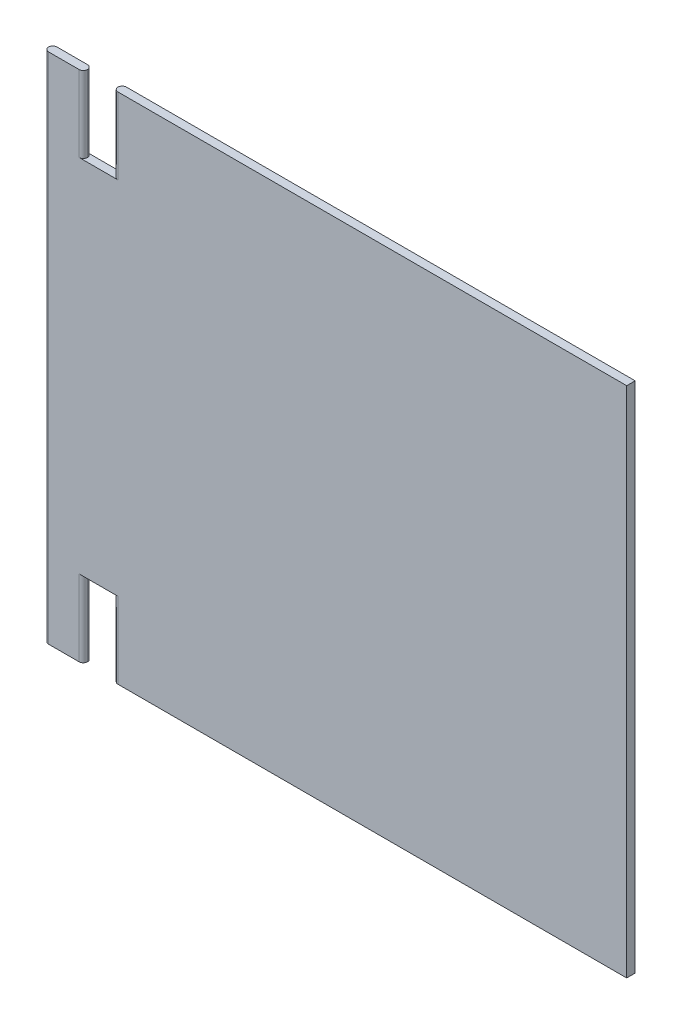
ISO-10303-21;
HEADER;
FILE_DESCRIPTION(('STEP AP214'),'2;1');
FILE_NAME('part.step','',(''),(''),'','','');
FILE_SCHEMA(('AUTOMOTIVE_DESIGN { 1 0 10303 214 1 1 1 1 }'));
ENDSEC;
DATA;
#1=APPLICATION_CONTEXT('core data for automotive mechanical design processes');
#2=APPLICATION_PROTOCOL_DEFINITION('international standard','automotive_design',2000,#1);
#3=PRODUCT_CONTEXT('',#1,'mechanical');
#4=PRODUCT('Part','Part','',(#3));
#5=PRODUCT_RELATED_PRODUCT_CATEGORY('part','',(#4));
#6=PRODUCT_DEFINITION_FORMATION('','',#4);
#7=PRODUCT_DEFINITION_CONTEXT('part definition',#1,'design');
#8=PRODUCT_DEFINITION('design','',#6,#7);
#9=PRODUCT_DEFINITION_SHAPE('','',#8);
#10=(LENGTH_UNIT() NAMED_UNIT(*) SI_UNIT(.MILLI.,.METRE.));
#11=(NAMED_UNIT(*) PLANE_ANGLE_UNIT() SI_UNIT($,.RADIAN.));
#12=(NAMED_UNIT(*) SI_UNIT($,.STERADIAN.) SOLID_ANGLE_UNIT());
#13=UNCERTAINTY_MEASURE_WITH_UNIT(LENGTH_MEASURE(1.E-05),#10,'distance_accuracy_value','');
#14=(GEOMETRIC_REPRESENTATION_CONTEXT(3) GLOBAL_UNCERTAINTY_ASSIGNED_CONTEXT((#13)) GLOBAL_UNIT_ASSIGNED_CONTEXT((#10,
#11,#12)) REPRESENTATION_CONTEXT('',''));
#15=CARTESIAN_POINT('',(0.,0.,0.));
#16=DIRECTION('',(0.,0.,1.));
#17=DIRECTION('',(1.,0.,0.));
#18=AXIS2_PLACEMENT_3D('',#15,#16,#17);
#19=CARTESIAN_POINT('',(38.481,-38.481,1.27));
#20=DIRECTION('',(0.,1.,0.));
#21=DIRECTION('',(-1.,0.,0.));
#22=AXIS2_PLACEMENT_3D('',#19,#20,#21);
#23=PLANE('',#22);
#24=DIRECTION('',(1.,0.,0.));
#25=VECTOR('',#24,1.);
#26=CARTESIAN_POINT('',(38.481,-38.481,1.27));
#27=LINE('',#26,#25);
#28=CARTESIAN_POINT('',(-37.846,-38.481,1.27));
#29=VERTEX_POINT('',#28);
#30=CARTESIAN_POINT('',(38.481,-38.481,1.27));
#31=VERTEX_POINT('',#30);
#32=EDGE_CURVE('E158',#29,#31,#27,.T.);
#33=ORIENTED_EDGE('',*,*,#32,.F.);
#34=CARTESIAN_POINT('',(-37.846,-38.481,0.635));
#35=DIRECTION('',(0.,1.,0.));
#36=DIRECTION('',(-1.,0.,0.));
#37=AXIS2_PLACEMENT_3D('',#34,#35,#36);
#38=CIRCLE('',#37,0.635);
#39=CARTESIAN_POINT('',(-38.481,-38.481,0.635));
#40=VERTEX_POINT('',#39);
#41=EDGE_CURVE('E253',#29,#40,#38,.F.);
#42=ORIENTED_EDGE('',*,*,#41,.T.);
#43=CARTESIAN_POINT('',(-37.846,-38.481,0.635));
#44=DIRECTION('',(0.,1.,0.));
#45=DIRECTION('',(-1.,0.,0.));
#46=AXIS2_PLACEMENT_3D('',#43,#44,#45);
#47=CIRCLE('',#46,0.635);
#48=CARTESIAN_POINT('',(-37.846,-38.481,0.));
#49=VERTEX_POINT('',#48);
#50=EDGE_CURVE('E251',#40,#49,#47,.F.);
#51=ORIENTED_EDGE('',*,*,#50,.T.);
#52=DIRECTION('',(1.,0.,0.));
#53=VECTOR('',#52,1.);
#54=CARTESIAN_POINT('',(38.481,-38.481,0.));
#55=LINE('',#54,#53);
#56=CARTESIAN_POINT('',(38.481,-38.481,0.));
#57=VERTEX_POINT('',#56);
#58=EDGE_CURVE('E173',#49,#57,#55,.T.);
#59=ORIENTED_EDGE('',*,*,#58,.T.);
#60=DIRECTION('',(0.,0.,-1.));
#61=VECTOR('',#60,1.);
#62=CARTESIAN_POINT('',(38.481,-38.481,1.27));
#63=LINE('',#62,#61);
#64=EDGE_CURVE('E171',#31,#57,#63,.T.);
#65=ORIENTED_EDGE('',*,*,#64,.F.);
#66=EDGE_LOOP('',(#33,#42,#51,#59,#65));
#67=FACE_BOUND('',#66,.T.);
#68=ADVANCED_FACE('F37',(#67),#23,.F.);
#69=CARTESIAN_POINT('',(38.481,-38.481,1.27));
#70=DIRECTION('',(-1.,0.,0.));
#71=DIRECTION('',(0.,0.,1.));
#72=AXIS2_PLACEMENT_3D('',#69,#70,#71);
#73=PLANE('',#72);
#74=DIRECTION('',(0.,1.,0.));
#75=VECTOR('',#74,1.);
#76=CARTESIAN_POINT('',(38.481,-38.481,0.));
#77=LINE('',#76,#75);
#78=CARTESIAN_POINT('',(38.481,38.481,0.));
#79=VERTEX_POINT('',#78);
#80=EDGE_CURVE('E188',#57,#79,#77,.T.);
#81=ORIENTED_EDGE('',*,*,#80,.T.);
#82=DIRECTION('',(0.,0.,-1.));
#83=VECTOR('',#82,1.);
#84=CARTESIAN_POINT('',(38.481,38.481,1.27));
#85=LINE('',#84,#83);
#86=CARTESIAN_POINT('',(38.481,38.481,1.27));
#87=VERTEX_POINT('',#86);
#88=EDGE_CURVE('E177',#87,#79,#85,.T.);
#89=ORIENTED_EDGE('',*,*,#88,.F.);
#90=DIRECTION('',(0.,1.,0.));
#91=VECTOR('',#90,1.);
#92=CARTESIAN_POINT('',(38.481,-38.481,1.27));
#93=LINE('',#92,#91);
#94=EDGE_CURVE('E163',#31,#87,#93,.T.);
#95=ORIENTED_EDGE('',*,*,#94,.F.);
#96=ORIENTED_EDGE('',*,*,#64,.T.);
#97=EDGE_LOOP('',(#81,#89,#95,#96));
#98=FACE_BOUND('',#97,.T.);
#99=ADVANCED_FACE('F179',(#98),#73,.F.);
#100=CARTESIAN_POINT('',(38.481,38.481,1.27));
#101=DIRECTION('',(0.,-1.,0.));
#102=DIRECTION('',(1.,0.,0.));
#103=AXIS2_PLACEMENT_3D('',#100,#101,#102);
#104=PLANE('',#103);
#105=CARTESIAN_POINT('',(-37.846,38.481,0.635));
#106=DIRECTION('',(0.,-1.,0.));
#107=DIRECTION('',(1.,0.,0.));
#108=AXIS2_PLACEMENT_3D('',#105,#106,#107);
#109=CIRCLE('',#108,0.635);
#110=CARTESIAN_POINT('',(-37.846,38.481,0.));
#111=VERTEX_POINT('',#110);
#112=CARTESIAN_POINT('',(-38.481,38.481,0.635));
#113=VERTEX_POINT('',#112);
#114=EDGE_CURVE('E260',#111,#113,#109,.F.);
#115=ORIENTED_EDGE('',*,*,#114,.T.);
#116=CARTESIAN_POINT('',(-37.846,38.481,0.635));
#117=DIRECTION('',(0.,-1.,0.));
#118=DIRECTION('',(1.,0.,0.));
#119=AXIS2_PLACEMENT_3D('',#116,#117,#118);
#120=CIRCLE('',#119,0.635);
#121=CARTESIAN_POINT('',(-37.846,38.481,1.27));
#122=VERTEX_POINT('',#121);
#123=EDGE_CURVE('E262',#113,#122,#120,.F.);
#124=ORIENTED_EDGE('',*,*,#123,.T.);
#125=DIRECTION('',(-1.,0.,0.));
#126=VECTOR('',#125,1.);
#127=CARTESIAN_POINT('',(38.481,38.481,1.27));
#128=LINE('',#127,#126);
#129=EDGE_CURVE('E182',#87,#122,#128,.T.);
#130=ORIENTED_EDGE('',*,*,#129,.F.);
#131=ORIENTED_EDGE('',*,*,#88,.T.);
#132=DIRECTION('',(-1.,0.,0.));
#133=VECTOR('',#132,1.);
#134=CARTESIAN_POINT('',(38.481,38.481,0.));
#135=LINE('',#134,#133);
#136=EDGE_CURVE('E168',#79,#111,#135,.T.);
#137=ORIENTED_EDGE('',*,*,#136,.T.);
#138=EDGE_LOOP('',(#115,#124,#130,#131,#137));
#139=FACE_BOUND('',#138,.T.);
#140=ADVANCED_FACE('F340',(#139),#104,.F.);
#141=CARTESIAN_POINT('',(0.,0.,1.27));
#142=DIRECTION('',(0.,0.,1.));
#143=DIRECTION('',(1.,0.,0.));
#144=AXIS2_PLACEMENT_3D('',#141,#142,#143);
#145=PLANE('',#144);
#146=DIRECTION('',(1.,0.,0.));
#147=VECTOR('',#146,1.);
#148=CARTESIAN_POINT('',(-43.053,-27.051,1.27000000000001));
#149=LINE('',#148,#147);
#150=CARTESIAN_POINT('',(-43.688,-27.051,1.27000000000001));
#151=VERTEX_POINT('',#150);
#152=CARTESIAN_POINT('',(-37.846,-27.051,1.27000000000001));
#153=VERTEX_POINT('',#152);
#154=EDGE_CURVE('E299',#151,#153,#149,.T.);
#155=ORIENTED_EDGE('',*,*,#154,.T.);
#156=DIRECTION('',(0.,-1.,0.));
#157=VECTOR('',#156,1.);
#158=CARTESIAN_POINT('',(-37.846,-38.481,1.27));
#159=LINE('',#158,#157);
#160=EDGE_CURVE('E166',#153,#29,#159,.T.);
#161=ORIENTED_EDGE('',*,*,#160,.T.);
#162=ORIENTED_EDGE('',*,*,#32,.T.);
#163=ORIENTED_EDGE('',*,*,#94,.T.);
#164=ORIENTED_EDGE('',*,*,#129,.T.);
#165=DIRECTION('',(0.,-1.,0.));
#166=VECTOR('',#165,1.);
#167=CARTESIAN_POINT('',(-37.846,27.051,1.27));
#168=LINE('',#167,#166);
#169=CARTESIAN_POINT('',(-37.846,27.051,1.27));
#170=VERTEX_POINT('',#169);
#171=EDGE_CURVE('E236',#122,#170,#168,.T.);
#172=ORIENTED_EDGE('',*,*,#171,.T.);
#173=DIRECTION('',(1.,0.,0.));
#174=VECTOR('',#173,1.);
#175=CARTESIAN_POINT('',(-43.053,27.051,1.27));
#176=LINE('',#175,#174);
#177=CARTESIAN_POINT('',(-43.688,27.051,1.27));
#178=VERTEX_POINT('',#177);
#179=EDGE_CURVE('E189',#178,#170,#176,.T.);
#180=ORIENTED_EDGE('',*,*,#179,.F.);
#181=DIRECTION('',(0.,1.,0.));
#182=VECTOR('',#181,1.);
#183=CARTESIAN_POINT('',(-43.688,38.481,1.27));
#184=LINE('',#183,#182);
#185=CARTESIAN_POINT('',(-43.688,38.481,1.26999999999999));
#186=VERTEX_POINT('',#185);
#187=EDGE_CURVE('E198',#178,#186,#184,.T.);
#188=ORIENTED_EDGE('',*,*,#187,.T.);
#189=DIRECTION('',(1.,0.,0.));
#190=VECTOR('',#189,1.);
#191=CARTESIAN_POINT('',(-48.895,38.481,1.26999999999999));
#192=LINE('',#191,#190);
#193=CARTESIAN_POINT('',(-48.26,38.481,1.26999999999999));
#194=VERTEX_POINT('',#193);
#195=EDGE_CURVE('E307',#194,#186,#192,.T.);
#196=ORIENTED_EDGE('',*,*,#195,.F.);
#197=DIRECTION('',(0.,1.,0.));
#198=VECTOR('',#197,1.);
#199=CARTESIAN_POINT('',(-48.26,0.,1.27));
#200=LINE('',#199,#198);
#201=CARTESIAN_POINT('',(-48.26,-38.481,1.27));
#202=VERTEX_POINT('',#201);
#203=EDGE_CURVE('E176',#194,#202,#200,.F.);
#204=ORIENTED_EDGE('',*,*,#203,.T.);
#205=DIRECTION('',(1.,0.,0.));
#206=VECTOR('',#205,1.);
#207=CARTESIAN_POINT('',(-48.895,-38.481,1.27));
#208=LINE('',#207,#206);
#209=CARTESIAN_POINT('',(-43.688,-38.481,1.27));
#210=VERTEX_POINT('',#209);
#211=EDGE_CURVE('E304',#202,#210,#208,.T.);
#212=ORIENTED_EDGE('',*,*,#211,.T.);
#213=DIRECTION('',(0.,1.,0.));
#214=VECTOR('',#213,1.);
#215=CARTESIAN_POINT('',(-43.688,-27.051,1.27));
#216=LINE('',#215,#214);
#217=EDGE_CURVE('E195',#210,#151,#216,.T.);
#218=ORIENTED_EDGE('',*,*,#217,.T.);
#219=EDGE_LOOP('',(#155,#161,#162,#163,#164,#172,#180,#188,#196,#204,#212,#218));
#220=FACE_BOUND('',#219,.T.);
#221=ADVANCED_FACE('F160',(#220),#145,.T.);
#222=CARTESIAN_POINT('',(0.,0.,0.));
#223=DIRECTION('',(0.,0.,1.));
#224=DIRECTION('',(1.,0.,0.));
#225=AXIS2_PLACEMENT_3D('',#222,#223,#224);
#226=PLANE('',#225);
#227=ORIENTED_EDGE('',*,*,#58,.F.);
#228=DIRECTION('',(0.,-1.,0.));
#229=VECTOR('',#228,1.);
#230=CARTESIAN_POINT('',(-37.846,0.,0.));
#231=LINE('',#230,#229);
#232=CARTESIAN_POINT('',(-37.846,-27.051,0.));
#233=VERTEX_POINT('',#232);
#234=EDGE_CURVE('E257',#49,#233,#231,.F.);
#235=ORIENTED_EDGE('',*,*,#234,.T.);
#236=DIRECTION('',(1.,0.,0.));
#237=VECTOR('',#236,1.);
#238=CARTESIAN_POINT('',(-43.053,-27.051,0.));
#239=LINE('',#238,#237);
#240=CARTESIAN_POINT('',(-43.688,-27.051,0.));
#241=VERTEX_POINT('',#240);
#242=EDGE_CURVE('E284',#241,#233,#239,.T.);
#243=ORIENTED_EDGE('',*,*,#242,.F.);
#244=DIRECTION('',(0.,-1.,0.));
#245=VECTOR('',#244,1.);
#246=CARTESIAN_POINT('',(-43.688,0.,0.));
#247=LINE('',#246,#245);
#248=CARTESIAN_POINT('',(-43.688,-38.481,0.));
#249=VERTEX_POINT('',#248);
#250=EDGE_CURVE('E212',#241,#249,#247,.T.);
#251=ORIENTED_EDGE('',*,*,#250,.T.);
#252=DIRECTION('',(1.,0.,0.));
#253=VECTOR('',#252,1.);
#254=CARTESIAN_POINT('',(-48.895,-38.481,0.));
#255=LINE('',#254,#253);
#256=CARTESIAN_POINT('',(-48.26,-38.481,0.));
#257=VERTEX_POINT('',#256);
#258=EDGE_CURVE('E301',#257,#249,#255,.T.);
#259=ORIENTED_EDGE('',*,*,#258,.F.);
#260=DIRECTION('',(0.,-1.,0.));
#261=VECTOR('',#260,1.);
#262=CARTESIAN_POINT('',(-48.26,38.481,0.));
#263=LINE('',#262,#261);
#264=CARTESIAN_POINT('',(-48.26,38.481,0.));
#265=VERTEX_POINT('',#264);
#266=EDGE_CURVE('E209',#257,#265,#263,.F.);
#267=ORIENTED_EDGE('',*,*,#266,.T.);
#268=DIRECTION('',(1.,0.,0.));
#269=VECTOR('',#268,1.);
#270=CARTESIAN_POINT('',(-48.895,38.481,0.));
#271=LINE('',#270,#269);
#272=CARTESIAN_POINT('',(-43.688,38.481,0.));
#273=VERTEX_POINT('',#272);
#274=EDGE_CURVE('E240',#265,#273,#271,.T.);
#275=ORIENTED_EDGE('',*,*,#274,.T.);
#276=DIRECTION('',(0.,-1.,0.));
#277=VECTOR('',#276,1.);
#278=CARTESIAN_POINT('',(-43.688,0.,0.));
#279=LINE('',#278,#277);
#280=CARTESIAN_POINT('',(-43.688,27.051,0.));
#281=VERTEX_POINT('',#280);
#282=EDGE_CURVE('E215',#273,#281,#279,.T.);
#283=ORIENTED_EDGE('',*,*,#282,.T.);
#284=DIRECTION('',(1.,0.,0.));
#285=VECTOR('',#284,1.);
#286=CARTESIAN_POINT('',(-43.053,27.051,0.));
#287=LINE('',#286,#285);
#288=CARTESIAN_POINT('',(-37.846,27.051,0.));
#289=VERTEX_POINT('',#288);
#290=EDGE_CURVE('E280',#281,#289,#287,.T.);
#291=ORIENTED_EDGE('',*,*,#290,.T.);
#292=DIRECTION('',(0.,-1.,0.));
#293=VECTOR('',#292,1.);
#294=CARTESIAN_POINT('',(-37.846,0.,0.));
#295=LINE('',#294,#293);
#296=EDGE_CURVE('E255',#289,#111,#295,.F.);
#297=ORIENTED_EDGE('',*,*,#296,.T.);
#298=ORIENTED_EDGE('',*,*,#136,.F.);
#299=ORIENTED_EDGE('',*,*,#80,.F.);
#300=EDGE_LOOP('',(#227,#235,#243,#251,#259,#267,#275,#283,#291,#297,#298,#299));
#301=FACE_BOUND('',#300,.T.);
#302=ADVANCED_FACE('F288',(#301),#226,.F.);
#303=CARTESIAN_POINT('',(-43.053,27.051,1.27));
#304=DIRECTION('',(0.,-1.,0.));
#305=DIRECTION('',(0.,0.,-1.));
#306=AXIS2_PLACEMENT_3D('',#303,#304,#305);
#307=PLANE('',#306);
#308=CARTESIAN_POINT('',(-37.846,27.051,0.635));
#309=DIRECTION('',(0.,-1.,0.));
#310=DIRECTION('',(0.,0.,-1.));
#311=AXIS2_PLACEMENT_3D('',#308,#309,#310);
#312=CIRCLE('',#311,0.635);
#313=CARTESIAN_POINT('',(-38.481,27.051,0.635));
#314=VERTEX_POINT('',#313);
#315=EDGE_CURVE('E46',#170,#314,#312,.T.);
#316=ORIENTED_EDGE('',*,*,#315,.T.);
#317=CARTESIAN_POINT('',(-37.846,27.051,0.635));
#318=DIRECTION('',(0.,-1.,0.));
#319=DIRECTION('',(0.,0.,-1.));
#320=AXIS2_PLACEMENT_3D('',#317,#318,#319);
#321=CIRCLE('',#320,0.635);
#322=EDGE_CURVE('E11',#314,#289,#321,.T.);
#323=ORIENTED_EDGE('',*,*,#322,.T.);
#324=ORIENTED_EDGE('',*,*,#290,.F.);
#325=CARTESIAN_POINT('',(-43.688,27.051,0.635));
#326=DIRECTION('',(0.,-1.,0.));
#327=DIRECTION('',(0.,0.,-1.));
#328=AXIS2_PLACEMENT_3D('',#325,#326,#327);
#329=CIRCLE('',#328,0.635);
#330=CARTESIAN_POINT('',(-43.053,27.051,0.635));
#331=VERTEX_POINT('',#330);
#332=EDGE_CURVE('E229',#281,#331,#329,.T.);
#333=ORIENTED_EDGE('',*,*,#332,.T.);
#334=CARTESIAN_POINT('',(-43.688,27.051,0.635));
#335=DIRECTION('',(0.,-1.,0.));
#336=DIRECTION('',(0.,0.,-1.));
#337=AXIS2_PLACEMENT_3D('',#334,#335,#336);
#338=CIRCLE('',#337,0.635);
#339=EDGE_CURVE('E226',#331,#178,#338,.T.);
#340=ORIENTED_EDGE('',*,*,#339,.T.);
#341=ORIENTED_EDGE('',*,*,#179,.T.);
#342=EDGE_LOOP('',(#316,#323,#324,#333,#340,#341));
#343=FACE_BOUND('',#342,.T.);
#344=ADVANCED_FACE('F279',(#343),#307,.F.);
#345=CARTESIAN_POINT('',(-43.053,-27.051,1.27000000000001));
#346=DIRECTION('',(0.,1.,0.));
#347=DIRECTION('',(0.,0.,1.));
#348=AXIS2_PLACEMENT_3D('',#345,#346,#347);
#349=PLANE('',#348);
#350=ORIENTED_EDGE('',*,*,#242,.T.);
#351=CARTESIAN_POINT('',(-37.846,-27.051,0.635));
#352=DIRECTION('',(0.,1.,0.));
#353=DIRECTION('',(0.,0.,1.));
#354=AXIS2_PLACEMENT_3D('',#351,#352,#353);
#355=CIRCLE('',#354,0.635);
#356=CARTESIAN_POINT('',(-38.481,-27.051,0.635));
#357=VERTEX_POINT('',#356);
#358=EDGE_CURVE('E60',#233,#357,#355,.T.);
#359=ORIENTED_EDGE('',*,*,#358,.T.);
#360=CARTESIAN_POINT('',(-37.846,-27.051,0.635));
#361=DIRECTION('',(0.,1.,0.));
#362=DIRECTION('',(0.,0.,1.));
#363=AXIS2_PLACEMENT_3D('',#360,#361,#362);
#364=CIRCLE('',#363,0.635);
#365=EDGE_CURVE('E264',#357,#153,#364,.T.);
#366=ORIENTED_EDGE('',*,*,#365,.T.);
#367=ORIENTED_EDGE('',*,*,#154,.F.);
#368=CARTESIAN_POINT('',(-43.688,-27.051,0.635));
#369=DIRECTION('',(0.,1.,0.));
#370=DIRECTION('',(0.,0.,1.));
#371=AXIS2_PLACEMENT_3D('',#368,#369,#370);
#372=CIRCLE('',#371,0.635);
#373=CARTESIAN_POINT('',(-43.053,-27.051,0.635));
#374=VERTEX_POINT('',#373);
#375=EDGE_CURVE('E234',#151,#374,#372,.T.);
#376=ORIENTED_EDGE('',*,*,#375,.T.);
#377=CARTESIAN_POINT('',(-43.688,-27.051,0.635));
#378=DIRECTION('',(0.,1.,0.));
#379=DIRECTION('',(0.,0.,1.));
#380=AXIS2_PLACEMENT_3D('',#377,#378,#379);
#381=CIRCLE('',#380,0.635);
#382=EDGE_CURVE('E231',#374,#241,#381,.T.);
#383=ORIENTED_EDGE('',*,*,#382,.T.);
#384=EDGE_LOOP('',(#350,#359,#366,#367,#376,#383));
#385=FACE_BOUND('',#384,.T.);
#386=ADVANCED_FACE('F331',(#385),#349,.F.);
#387=CARTESIAN_POINT('',(-48.895,-38.481,0.));
#388=DIRECTION('',(0.,1.,0.));
#389=DIRECTION('',(0.,0.,1.));
#390=AXIS2_PLACEMENT_3D('',#387,#388,#389);
#391=PLANE('',#390);
#392=ORIENTED_EDGE('',*,*,#258,.T.);
#393=CARTESIAN_POINT('',(-43.688,-38.481,0.635));
#394=DIRECTION('',(0.,1.,0.));
#395=DIRECTION('',(0.,0.,1.));
#396=AXIS2_PLACEMENT_3D('',#393,#394,#395);
#397=CIRCLE('',#396,0.635);
#398=CARTESIAN_POINT('',(-43.053,-38.481,0.635));
#399=VERTEX_POINT('',#398);
#400=EDGE_CURVE('E224',#249,#399,#397,.F.);
#401=ORIENTED_EDGE('',*,*,#400,.T.);
#402=CARTESIAN_POINT('',(-43.688,-38.481,0.635));
#403=DIRECTION('',(0.,1.,0.));
#404=DIRECTION('',(0.,0.,1.));
#405=AXIS2_PLACEMENT_3D('',#402,#403,#404);
#406=CIRCLE('',#405,0.635);
#407=EDGE_CURVE('E222',#399,#210,#406,.F.);
#408=ORIENTED_EDGE('',*,*,#407,.T.);
#409=ORIENTED_EDGE('',*,*,#211,.F.);
#410=CARTESIAN_POINT('',(-48.26,-38.481,0.635));
#411=DIRECTION('',(0.,1.,0.));
#412=DIRECTION('',(0.,0.,1.));
#413=AXIS2_PLACEMENT_3D('',#410,#411,#412);
#414=CIRCLE('',#413,0.635);
#415=CARTESIAN_POINT('',(-48.895,-38.481,0.635));
#416=VERTEX_POINT('',#415);
#417=EDGE_CURVE('E218',#202,#416,#414,.F.);
#418=ORIENTED_EDGE('',*,*,#417,.T.);
#419=CARTESIAN_POINT('',(-48.26,-38.481,0.635));
#420=DIRECTION('',(0.,1.,0.));
#421=DIRECTION('',(0.,0.,1.));
#422=AXIS2_PLACEMENT_3D('',#419,#420,#421);
#423=CIRCLE('',#422,0.635);
#424=EDGE_CURVE('E220',#416,#257,#423,.F.);
#425=ORIENTED_EDGE('',*,*,#424,.T.);
#426=EDGE_LOOP('',(#392,#401,#408,#409,#418,#425));
#427=FACE_BOUND('',#426,.T.);
#428=ADVANCED_FACE('F322',(#427),#391,.F.);
#429=CARTESIAN_POINT('',(-48.895,38.481,0.));
#430=DIRECTION('',(0.,-1.,0.));
#431=DIRECTION('',(0.,0.,-1.));
#432=AXIS2_PLACEMENT_3D('',#429,#430,#431);
#433=PLANE('',#432);
#434=ORIENTED_EDGE('',*,*,#195,.T.);
#435=CARTESIAN_POINT('',(-43.688,38.481,0.635));
#436=DIRECTION('',(0.,-1.,0.));
#437=DIRECTION('',(0.,0.,-1.));
#438=AXIS2_PLACEMENT_3D('',#435,#436,#437);
#439=CIRCLE('',#438,0.635);
#440=CARTESIAN_POINT('',(-43.053,38.481,0.635));
#441=VERTEX_POINT('',#440);
#442=EDGE_CURVE('E207',#186,#441,#439,.F.);
#443=ORIENTED_EDGE('',*,*,#442,.T.);
#444=CARTESIAN_POINT('',(-43.688,38.481,0.635));
#445=DIRECTION('',(0.,-1.,0.));
#446=DIRECTION('',(0.,0.,-1.));
#447=AXIS2_PLACEMENT_3D('',#444,#445,#446);
#448=CIRCLE('',#447,0.635);
#449=EDGE_CURVE('E205',#441,#273,#448,.F.);
#450=ORIENTED_EDGE('',*,*,#449,.T.);
#451=ORIENTED_EDGE('',*,*,#274,.F.);
#452=CARTESIAN_POINT('',(-48.26,38.481,0.635));
#453=DIRECTION('',(0.,-1.,0.));
#454=DIRECTION('',(0.,0.,-1.));
#455=AXIS2_PLACEMENT_3D('',#452,#453,#454);
#456=CIRCLE('',#455,0.635);
#457=CARTESIAN_POINT('',(-48.895,38.481,0.635));
#458=VERTEX_POINT('',#457);
#459=EDGE_CURVE('E203',#265,#458,#456,.F.);
#460=ORIENTED_EDGE('',*,*,#459,.T.);
#461=CARTESIAN_POINT('',(-48.26,38.481,0.635));
#462=DIRECTION('',(0.,-1.,0.));
#463=DIRECTION('',(0.,0.,-1.));
#464=AXIS2_PLACEMENT_3D('',#461,#462,#463);
#465=CIRCLE('',#464,0.635);
#466=EDGE_CURVE('E201',#458,#194,#465,.F.);
#467=ORIENTED_EDGE('',*,*,#466,.T.);
#468=EDGE_LOOP('',(#434,#443,#450,#451,#460,#467));
#469=FACE_BOUND('',#468,.T.);
#470=ADVANCED_FACE('F312',(#469),#433,.F.);
#471=CARTESIAN_POINT('',(-43.688,0.,0.635));
#472=DIRECTION('',(0.,-1.,0.));
#473=DIRECTION('',(0.,0.,-1.));
#474=AXIS2_PLACEMENT_3D('',#471,#472,#473);
#475=CYLINDRICAL_SURFACE('',#474,0.635);
#476=DIRECTION('',(0.,-1.,0.));
#477=VECTOR('',#476,1.);
#478=CARTESIAN_POINT('',(-43.053,0.,0.635));
#479=LINE('',#478,#477);
#480=EDGE_CURVE('E237',#331,#441,#479,.F.);
#481=ORIENTED_EDGE('',*,*,#480,.F.);
#482=ORIENTED_EDGE('',*,*,#332,.F.);
#483=ORIENTED_EDGE('',*,*,#282,.F.);
#484=ORIENTED_EDGE('',*,*,#449,.F.);
#485=EDGE_LOOP('',(#481,#482,#483,#484));
#486=FACE_BOUND('',#485,.T.);
#487=ADVANCED_FACE('F292',(#486),#475,.T.);
#488=CARTESIAN_POINT('',(-43.688,0.,0.635));
#489=DIRECTION('',(0.,-1.,0.));
#490=DIRECTION('',(0.,0.,-1.));
#491=AXIS2_PLACEMENT_3D('',#488,#489,#490);
#492=CYLINDRICAL_SURFACE('',#491,0.635);
#493=ORIENTED_EDGE('',*,*,#339,.F.);
#494=ORIENTED_EDGE('',*,*,#480,.T.);
#495=ORIENTED_EDGE('',*,*,#442,.F.);
#496=ORIENTED_EDGE('',*,*,#187,.F.);
#497=EDGE_LOOP('',(#493,#494,#495,#496));
#498=FACE_BOUND('',#497,.T.);
#499=ADVANCED_FACE('F296',(#498),#492,.T.);
#500=CARTESIAN_POINT('',(-43.688,0.,0.635));
#501=DIRECTION('',(0.,-1.,0.));
#502=DIRECTION('',(0.,0.,-1.));
#503=AXIS2_PLACEMENT_3D('',#500,#501,#502);
#504=CYLINDRICAL_SURFACE('',#503,0.635);
#505=DIRECTION('',(0.,1.,0.));
#506=VECTOR('',#505,1.);
#507=CARTESIAN_POINT('',(-43.053,-38.481,0.635));
#508=LINE('',#507,#506);
#509=EDGE_CURVE('E241',#374,#399,#508,.F.);
#510=ORIENTED_EDGE('',*,*,#509,.F.);
#511=ORIENTED_EDGE('',*,*,#375,.F.);
#512=ORIENTED_EDGE('',*,*,#217,.F.);
#513=ORIENTED_EDGE('',*,*,#407,.F.);
#514=EDGE_LOOP('',(#510,#511,#512,#513));
#515=FACE_BOUND('',#514,.T.);
#516=ADVANCED_FACE('F329',(#515),#504,.T.);
#517=CARTESIAN_POINT('',(-43.688,0.,0.635));
#518=DIRECTION('',(0.,-1.,0.));
#519=DIRECTION('',(0.,0.,-1.));
#520=AXIS2_PLACEMENT_3D('',#517,#518,#519);
#521=CYLINDRICAL_SURFACE('',#520,0.635);
#522=ORIENTED_EDGE('',*,*,#382,.F.);
#523=ORIENTED_EDGE('',*,*,#509,.T.);
#524=ORIENTED_EDGE('',*,*,#400,.F.);
#525=ORIENTED_EDGE('',*,*,#250,.F.);
#526=EDGE_LOOP('',(#522,#523,#524,#525));
#527=FACE_BOUND('',#526,.T.);
#528=ADVANCED_FACE('F359',(#527),#521,.T.);
#529=CARTESIAN_POINT('',(-48.26,0.,0.635));
#530=DIRECTION('',(0.,1.,0.));
#531=DIRECTION('',(0.,0.,1.));
#532=AXIS2_PLACEMENT_3D('',#529,#530,#531);
#533=CYLINDRICAL_SURFACE('',#532,0.635);
#534=ORIENTED_EDGE('',*,*,#203,.F.);
#535=ORIENTED_EDGE('',*,*,#466,.F.);
#536=DIRECTION('',(0.,1.,0.));
#537=VECTOR('',#536,1.);
#538=CARTESIAN_POINT('',(-48.895,0.,0.635));
#539=LINE('',#538,#537);
#540=EDGE_CURVE('E244',#416,#458,#539,.T.);
#541=ORIENTED_EDGE('',*,*,#540,.F.);
#542=ORIENTED_EDGE('',*,*,#417,.F.);
#543=EDGE_LOOP('',(#534,#535,#541,#542));
#544=FACE_BOUND('',#543,.T.);
#545=ADVANCED_FACE('F318',(#544),#533,.T.);
#546=CARTESIAN_POINT('',(-48.26,0.,0.635));
#547=DIRECTION('',(0.,1.,0.));
#548=DIRECTION('',(0.,0.,1.));
#549=AXIS2_PLACEMENT_3D('',#546,#547,#548);
#550=CYLINDRICAL_SURFACE('',#549,0.635);
#551=ORIENTED_EDGE('',*,*,#459,.F.);
#552=ORIENTED_EDGE('',*,*,#266,.F.);
#553=ORIENTED_EDGE('',*,*,#424,.F.);
#554=ORIENTED_EDGE('',*,*,#540,.T.);
#555=EDGE_LOOP('',(#551,#552,#553,#554));
#556=FACE_BOUND('',#555,.T.);
#557=ADVANCED_FACE('F365',(#556),#550,.T.);
#558=CARTESIAN_POINT('',(-37.846,-38.481,0.635));
#559=DIRECTION('',(0.,-1.,0.));
#560=DIRECTION('',(0.,0.,-1.));
#561=AXIS2_PLACEMENT_3D('',#558,#559,#560);
#562=CYLINDRICAL_SURFACE('',#561,0.635);
#563=DIRECTION('',(0.,-1.,0.));
#564=VECTOR('',#563,1.);
#565=CARTESIAN_POINT('',(-38.481,-38.481,0.635));
#566=LINE('',#565,#564);
#567=EDGE_CURVE('E247',#357,#40,#566,.T.);
#568=ORIENTED_EDGE('',*,*,#567,.F.);
#569=ORIENTED_EDGE('',*,*,#358,.F.);
#570=ORIENTED_EDGE('',*,*,#234,.F.);
#571=ORIENTED_EDGE('',*,*,#50,.F.);
#572=EDGE_LOOP('',(#568,#569,#570,#571));
#573=FACE_BOUND('',#572,.T.);
#574=ADVANCED_FACE('F337',(#573),#562,.T.);
#575=CARTESIAN_POINT('',(-37.846,0.,0.635));
#576=DIRECTION('',(0.,1.,0.));
#577=DIRECTION('',(0.,0.,1.));
#578=AXIS2_PLACEMENT_3D('',#575,#576,#577);
#579=CYLINDRICAL_SURFACE('',#578,0.635);
#580=ORIENTED_EDGE('',*,*,#365,.F.);
#581=ORIENTED_EDGE('',*,*,#567,.T.);
#582=ORIENTED_EDGE('',*,*,#41,.F.);
#583=ORIENTED_EDGE('',*,*,#160,.F.);
#584=EDGE_LOOP('',(#580,#581,#582,#583));
#585=FACE_BOUND('',#584,.T.);
#586=ADVANCED_FACE('F333',(#585),#579,.T.);
#587=CARTESIAN_POINT('',(-37.846,-38.481,0.635));
#588=DIRECTION('',(0.,-1.,0.));
#589=DIRECTION('',(0.,0.,-1.));
#590=AXIS2_PLACEMENT_3D('',#587,#588,#589);
#591=CYLINDRICAL_SURFACE('',#590,0.635);
#592=DIRECTION('',(0.,-1.,0.));
#593=VECTOR('',#592,1.);
#594=CARTESIAN_POINT('',(-38.481,-38.481,0.635));
#595=LINE('',#594,#593);
#596=EDGE_CURVE('E41',#113,#314,#595,.T.);
#597=ORIENTED_EDGE('',*,*,#596,.F.);
#598=ORIENTED_EDGE('',*,*,#114,.F.);
#599=ORIENTED_EDGE('',*,*,#296,.F.);
#600=ORIENTED_EDGE('',*,*,#322,.F.);
#601=EDGE_LOOP('',(#597,#598,#599,#600));
#602=FACE_BOUND('',#601,.T.);
#603=ADVANCED_FACE('F39',(#602),#591,.T.);
#604=CARTESIAN_POINT('',(-37.846,0.,0.635));
#605=DIRECTION('',(0.,1.,0.));
#606=DIRECTION('',(0.,0.,1.));
#607=AXIS2_PLACEMENT_3D('',#604,#605,#606);
#608=CYLINDRICAL_SURFACE('',#607,0.635);
#609=ORIENTED_EDGE('',*,*,#123,.F.);
#610=ORIENTED_EDGE('',*,*,#596,.T.);
#611=ORIENTED_EDGE('',*,*,#315,.F.);
#612=ORIENTED_EDGE('',*,*,#171,.F.);
#613=EDGE_LOOP('',(#609,#610,#611,#612));
#614=FACE_BOUND('',#613,.T.);
#615=ADVANCED_FACE('F274',(#614),#608,.T.);
#616=CLOSED_SHELL('',(#68,#99,#140,#221,#302,#344,#386,#428,#470,#487,#499,#516,#528,#545,#557,
#574,#586,#603,#615));
#617=MANIFOLD_SOLID_BREP('B2',#616);
#618=ADVANCED_BREP_SHAPE_REPRESENTATION('',(#18,#617),#14);
#619=SHAPE_DEFINITION_REPRESENTATION(#9,#618);
ENDSEC;
END-ISO-10303-21;
